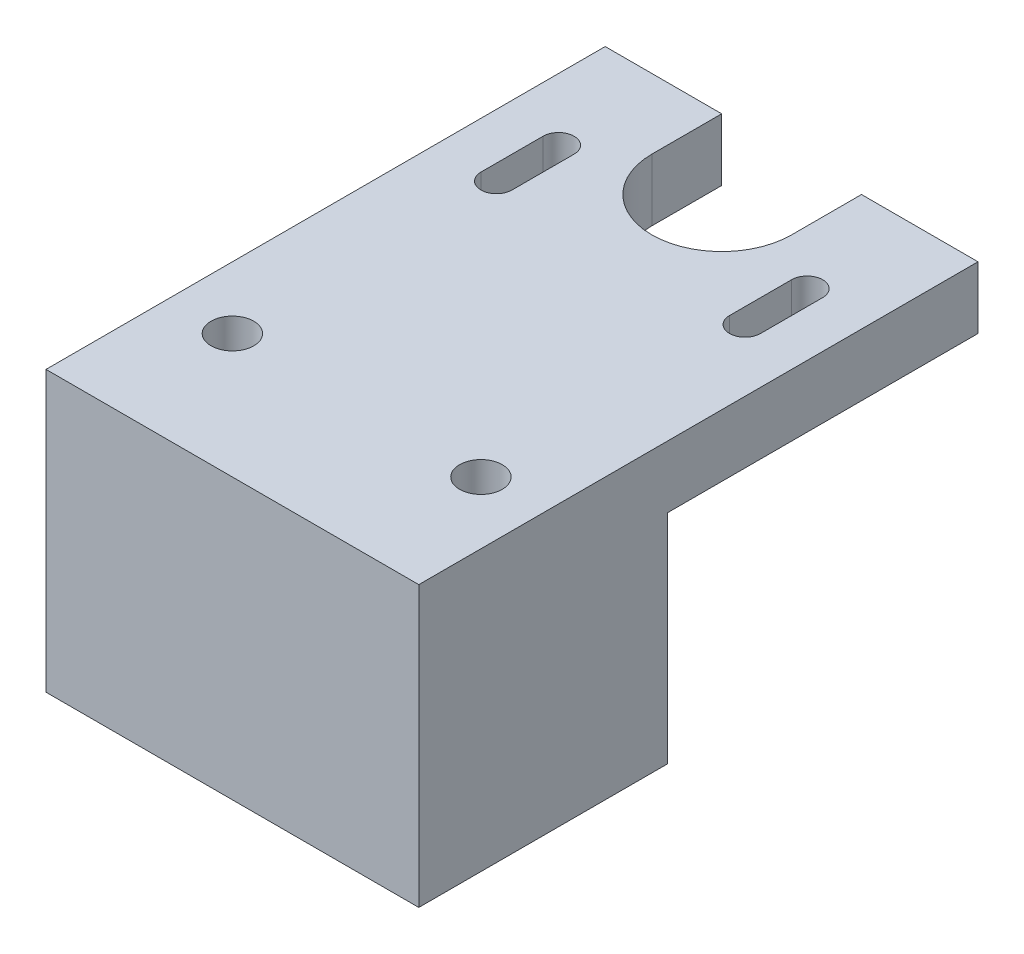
ISO-10303-21;
HEADER;
FILE_DESCRIPTION(('STEP AP214'),'2;1');
FILE_NAME('part.step','',(''),(''),'','','');
FILE_SCHEMA(('AUTOMOTIVE_DESIGN { 1 0 10303 214 1 1 1 1 }'));
ENDSEC;
DATA;
#1=APPLICATION_CONTEXT('core data for automotive mechanical design processes');
#2=APPLICATION_PROTOCOL_DEFINITION('international standard','automotive_design',2000,#1);
#3=PRODUCT_CONTEXT('',#1,'mechanical');
#4=PRODUCT('Part','Part','',(#3));
#5=PRODUCT_RELATED_PRODUCT_CATEGORY('part','',(#4));
#6=PRODUCT_DEFINITION_FORMATION('','',#4);
#7=PRODUCT_DEFINITION_CONTEXT('part definition',#1,'design');
#8=PRODUCT_DEFINITION('design','',#6,#7);
#9=PRODUCT_DEFINITION_SHAPE('','',#8);
#10=(LENGTH_UNIT() NAMED_UNIT(*) SI_UNIT(.MILLI.,.METRE.));
#11=(NAMED_UNIT(*) PLANE_ANGLE_UNIT() SI_UNIT($,.RADIAN.));
#12=(NAMED_UNIT(*) SI_UNIT($,.STERADIAN.) SOLID_ANGLE_UNIT());
#13=UNCERTAINTY_MEASURE_WITH_UNIT(LENGTH_MEASURE(1.E-05),#10,'distance_accuracy_value','');
#14=(GEOMETRIC_REPRESENTATION_CONTEXT(3) GLOBAL_UNCERTAINTY_ASSIGNED_CONTEXT((#13)) GLOBAL_UNIT_ASSIGNED_CONTEXT((#10,
#11,#12)) REPRESENTATION_CONTEXT('',''));
#15=CARTESIAN_POINT('',(0.,0.,0.));
#16=DIRECTION('',(0.,0.,1.));
#17=DIRECTION('',(1.,0.,0.));
#18=AXIS2_PLACEMENT_3D('',#15,#16,#17);
#19=CARTESIAN_POINT('',(38.1,57.15,-114.3));
#20=DIRECTION('',(0.,0.,1.));
#21=DIRECTION('',(0.,-1.,0.));
#22=AXIS2_PLACEMENT_3D('',#19,#20,#21);
#23=PLANE('',#22);
#24=DIRECTION('',(-1.,0.,0.));
#25=VECTOR('',#24,1.);
#26=CARTESIAN_POINT('',(38.1,44.4500000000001,-114.3));
#27=LINE('',#26,#25);
#28=CARTESIAN_POINT('',(38.1,44.4500000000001,-114.3));
#29=VERTEX_POINT('',#28);
#30=CARTESIAN_POINT('',(14.2875,44.4500000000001,-114.3));
#31=VERTEX_POINT('',#30);
#32=EDGE_CURVE('E316',#29,#31,#27,.T.);
#33=ORIENTED_EDGE('',*,*,#32,.T.);
#34=DIRECTION('',(0.,1.,0.));
#35=VECTOR('',#34,1.);
#36=CARTESIAN_POINT('',(14.2875,0.,-114.3));
#37=LINE('',#36,#35);
#38=CARTESIAN_POINT('',(14.2874999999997,57.15,-114.3));
#39=VERTEX_POINT('',#38);
#40=EDGE_CURVE('E226',#31,#39,#37,.T.);
#41=ORIENTED_EDGE('',*,*,#40,.T.);
#42=DIRECTION('',(-1.,0.,0.));
#43=VECTOR('',#42,1.);
#44=CARTESIAN_POINT('',(38.1,57.15,-114.3));
#45=LINE('',#44,#43);
#46=CARTESIAN_POINT('',(38.1,57.15,-114.3));
#47=VERTEX_POINT('',#46);
#48=EDGE_CURVE('E312',#47,#39,#45,.T.);
#49=ORIENTED_EDGE('',*,*,#48,.F.);
#50=DIRECTION('',(0.,1.,0.));
#51=VECTOR('',#50,1.);
#52=CARTESIAN_POINT('',(38.1,57.15,-114.3));
#53=LINE('',#52,#51);
#54=EDGE_CURVE('E286',#29,#47,#53,.T.);
#55=ORIENTED_EDGE('',*,*,#54,.F.);
#56=EDGE_LOOP('',(#33,#41,#49,#55));
#57=FACE_BOUND('',#56,.T.);
#58=ADVANCED_FACE('F44',(#57),#23,.F.);
#59=CARTESIAN_POINT('',(38.1,0.,-50.8));
#60=DIRECTION('',(0.,1.,0.));
#61=DIRECTION('',(0.,0.,1.));
#62=AXIS2_PLACEMENT_3D('',#59,#60,#61);
#63=PLANE('',#62);
#64=CARTESIAN_POINT('',(25.4,0.,-25.4));
#65=DIRECTION('',(0.,1.,0.));
#66=DIRECTION('',(0.,0.,-1.));
#67=AXIS2_PLACEMENT_3D('',#64,#65,#66);
#68=CIRCLE('',#67,4.3688);
#69=CARTESIAN_POINT('',(25.4,0.,-29.7688));
#70=VERTEX_POINT('',#69);
#71=EDGE_CURVE('E219',#70,#70,#68,.T.);
#72=ORIENTED_EDGE('',*,*,#71,.T.);
#73=EDGE_LOOP('',(#72));
#74=FACE_BOUND('',#73,.T.);
#75=CARTESIAN_POINT('',(-25.4000000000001,0.,-25.4));
#76=DIRECTION('',(0.,1.,0.));
#77=DIRECTION('',(0.,0.,1.));
#78=AXIS2_PLACEMENT_3D('',#75,#76,#77);
#79=CIRCLE('',#78,4.3688);
#80=CARTESIAN_POINT('',(-25.4000000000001,0.,-21.0312));
#81=VERTEX_POINT('',#80);
#82=EDGE_CURVE('E272',#81,#81,#79,.T.);
#83=ORIENTED_EDGE('',*,*,#82,.T.);
#84=EDGE_LOOP('',(#83));
#85=FACE_BOUND('',#84,.T.);
#86=DIRECTION('',(0.,0.,-1.));
#87=VECTOR('',#86,1.);
#88=CARTESIAN_POINT('',(-38.1000000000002,0.,-50.8));
#89=LINE('',#88,#87);
#90=CARTESIAN_POINT('',(-38.1000000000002,0.,0.));
#91=VERTEX_POINT('',#90);
#92=CARTESIAN_POINT('',(-38.1000000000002,0.,-50.8));
#93=VERTEX_POINT('',#92);
#94=EDGE_CURVE('E275',#91,#93,#89,.T.);
#95=ORIENTED_EDGE('',*,*,#94,.T.);
#96=DIRECTION('',(-1.,0.,0.));
#97=VECTOR('',#96,1.);
#98=CARTESIAN_POINT('',(38.1,0.,-50.8));
#99=LINE('',#98,#97);
#100=CARTESIAN_POINT('',(38.1,0.,-50.8));
#101=VERTEX_POINT('',#100);
#102=EDGE_CURVE('E13',#101,#93,#99,.T.);
#103=ORIENTED_EDGE('',*,*,#102,.F.);
#104=DIRECTION('',(0.,0.,-1.));
#105=VECTOR('',#104,1.);
#106=CARTESIAN_POINT('',(38.1,0.,-50.8));
#107=LINE('',#106,#105);
#108=CARTESIAN_POINT('',(38.1,0.,0.));
#109=VERTEX_POINT('',#108);
#110=EDGE_CURVE('E278',#109,#101,#107,.T.);
#111=ORIENTED_EDGE('',*,*,#110,.F.);
#112=DIRECTION('',(-1.,0.,0.));
#113=VECTOR('',#112,1.);
#114=CARTESIAN_POINT('',(38.1,0.,0.));
#115=LINE('',#114,#113);
#116=EDGE_CURVE('E292',#109,#91,#115,.T.);
#117=ORIENTED_EDGE('',*,*,#116,.T.);
#118=EDGE_LOOP('',(#95,#103,#111,#117));
#119=FACE_BOUND('',#118,.T.);
#120=ADVANCED_FACE('F46',(#74,#85,#119),#63,.F.);
#121=CARTESIAN_POINT('',(38.1,44.4500000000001,-50.8));
#122=DIRECTION('',(0.,0.,1.));
#123=DIRECTION('',(0.,-1.,0.));
#124=AXIS2_PLACEMENT_3D('',#121,#122,#123);
#125=PLANE('',#124);
#126=DIRECTION('',(0.,1.,0.));
#127=VECTOR('',#126,1.);
#128=CARTESIAN_POINT('',(-38.1000000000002,44.4500000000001,-50.8));
#129=LINE('',#128,#127);
#130=CARTESIAN_POINT('',(-38.1000000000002,44.4500000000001,-50.8));
#131=VERTEX_POINT('',#130);
#132=EDGE_CURVE('E295',#93,#131,#129,.T.);
#133=ORIENTED_EDGE('',*,*,#132,.T.);
#134=DIRECTION('',(-1.,0.,0.));
#135=VECTOR('',#134,1.);
#136=CARTESIAN_POINT('',(38.1,44.4500000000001,-50.8));
#137=LINE('',#136,#135);
#138=CARTESIAN_POINT('',(38.1,44.4500000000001,-50.8));
#139=VERTEX_POINT('',#138);
#140=EDGE_CURVE('E52',#139,#131,#137,.T.);
#141=ORIENTED_EDGE('',*,*,#140,.F.);
#142=DIRECTION('',(0.,1.,0.));
#143=VECTOR('',#142,1.);
#144=CARTESIAN_POINT('',(38.1,44.4500000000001,-50.8));
#145=LINE('',#144,#143);
#146=EDGE_CURVE('E281',#101,#139,#145,.T.);
#147=ORIENTED_EDGE('',*,*,#146,.F.);
#148=ORIENTED_EDGE('',*,*,#102,.T.);
#149=EDGE_LOOP('',(#133,#141,#147,#148));
#150=FACE_BOUND('',#149,.T.);
#151=ADVANCED_FACE('F357',(#150),#125,.F.);
#152=CARTESIAN_POINT('',(38.1,44.4500000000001,-114.3));
#153=DIRECTION('',(0.,1.,0.));
#154=DIRECTION('',(0.,0.,1.));
#155=AXIS2_PLACEMENT_3D('',#152,#153,#154);
#156=PLANE('',#155);
#157=DIRECTION('',(0.,0.,-1.));
#158=VECTOR('',#157,1.);
#159=CARTESIAN_POINT('',(-22.2250000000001,44.4500000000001,-114.3));
#160=LINE('',#159,#158);
#161=CARTESIAN_POINT('',(-22.2250000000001,44.4500000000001,-79.375));
#162=VERTEX_POINT('',#161);
#163=CARTESIAN_POINT('',(-22.2250000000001,44.4500000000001,-92.075));
#164=VERTEX_POINT('',#163);
#165=EDGE_CURVE('E265',#162,#164,#160,.T.);
#166=ORIENTED_EDGE('',*,*,#165,.T.);
#167=CARTESIAN_POINT('',(-25.4000000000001,44.4500000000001,-92.075));
#168=DIRECTION('',(0.,1.,0.));
#169=DIRECTION('',(0.,0.,1.));
#170=AXIS2_PLACEMENT_3D('',#167,#168,#169);
#171=CIRCLE('',#170,3.175);
#172=CARTESIAN_POINT('',(-28.5750000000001,44.4500000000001,-92.075));
#173=VERTEX_POINT('',#172);
#174=EDGE_CURVE('E268',#164,#173,#171,.T.);
#175=ORIENTED_EDGE('',*,*,#174,.T.);
#176=DIRECTION('',(0.,0.,1.));
#177=VECTOR('',#176,1.);
#178=CARTESIAN_POINT('',(-28.5750000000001,44.4500000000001,-114.3));
#179=LINE('',#178,#177);
#180=CARTESIAN_POINT('',(-28.5750000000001,44.4500000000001,-79.375));
#181=VERTEX_POINT('',#180);
#182=EDGE_CURVE('E259',#173,#181,#179,.T.);
#183=ORIENTED_EDGE('',*,*,#182,.T.);
#184=CARTESIAN_POINT('',(-25.4000000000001,44.4500000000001,-79.375));
#185=DIRECTION('',(0.,1.,0.));
#186=DIRECTION('',(0.,0.,1.));
#187=AXIS2_PLACEMENT_3D('',#184,#185,#186);
#188=CIRCLE('',#187,3.175);
#189=EDGE_CURVE('E262',#181,#162,#188,.T.);
#190=ORIENTED_EDGE('',*,*,#189,.T.);
#191=EDGE_LOOP('',(#166,#175,#183,#190));
#192=FACE_BOUND('',#191,.T.);
#193=DIRECTION('',(0.,0.,-1.));
#194=VECTOR('',#193,1.);
#195=CARTESIAN_POINT('',(28.575,44.4500000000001,-114.3));
#196=LINE('',#195,#194);
#197=CARTESIAN_POINT('',(28.575,44.4500000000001,-79.375));
#198=VERTEX_POINT('',#197);
#199=CARTESIAN_POINT('',(28.575,44.4500000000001,-92.075));
#200=VERTEX_POINT('',#199);
#201=EDGE_CURVE('E253',#198,#200,#196,.T.);
#202=ORIENTED_EDGE('',*,*,#201,.T.);
#203=CARTESIAN_POINT('',(25.3999999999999,44.4500000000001,-92.075));
#204=DIRECTION('',(0.,1.,0.));
#205=DIRECTION('',(0.,0.,1.));
#206=AXIS2_PLACEMENT_3D('',#203,#204,#205);
#207=CIRCLE('',#206,3.175);
#208=CARTESIAN_POINT('',(22.225,44.4500000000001,-92.075));
#209=VERTEX_POINT('',#208);
#210=EDGE_CURVE('E256',#200,#209,#207,.T.);
#211=ORIENTED_EDGE('',*,*,#210,.T.);
#212=DIRECTION('',(0.,0.,1.));
#213=VECTOR('',#212,1.);
#214=CARTESIAN_POINT('',(22.225,44.4500000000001,-114.3));
#215=LINE('',#214,#213);
#216=CARTESIAN_POINT('',(22.225,44.4500000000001,-79.375));
#217=VERTEX_POINT('',#216);
#218=EDGE_CURVE('E250',#209,#217,#215,.T.);
#219=ORIENTED_EDGE('',*,*,#218,.T.);
#220=CARTESIAN_POINT('',(25.3999999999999,44.4500000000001,-79.375));
#221=DIRECTION('',(0.,1.,0.));
#222=DIRECTION('',(0.,0.,1.));
#223=AXIS2_PLACEMENT_3D('',#220,#221,#222);
#224=CIRCLE('',#223,3.175);
#225=EDGE_CURVE('E174',#217,#198,#224,.T.);
#226=ORIENTED_EDGE('',*,*,#225,.T.);
#227=EDGE_LOOP('',(#202,#211,#219,#226));
#228=FACE_BOUND('',#227,.T.);
#229=CARTESIAN_POINT('',(0.,44.4500000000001,-100.0125));
#230=DIRECTION('',(0.,1.,0.));
#231=DIRECTION('',(0.,0.,1.));
#232=AXIS2_PLACEMENT_3D('',#229,#230,#231);
#233=CIRCLE('',#232,14.2875);
#234=CARTESIAN_POINT('',(-14.2875000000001,44.4500000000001,-100.0125));
#235=VERTEX_POINT('',#234);
#236=CARTESIAN_POINT('',(14.2875,44.4500000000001,-100.0125));
#237=VERTEX_POINT('',#236);
#238=EDGE_CURVE('E244',#235,#237,#233,.T.);
#239=ORIENTED_EDGE('',*,*,#238,.T.);
#240=DIRECTION('',(0.,0.,-1.));
#241=VECTOR('',#240,1.);
#242=CARTESIAN_POINT('',(14.2875,44.4500000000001,-114.3));
#243=LINE('',#242,#241);
#244=EDGE_CURVE('E247',#237,#31,#243,.T.);
#245=ORIENTED_EDGE('',*,*,#244,.T.);
#246=ORIENTED_EDGE('',*,*,#32,.F.);
#247=DIRECTION('',(0.,0.,-1.));
#248=VECTOR('',#247,1.);
#249=CARTESIAN_POINT('',(38.1,44.4500000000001,-114.3));
#250=LINE('',#249,#248);
#251=EDGE_CURVE('E284',#139,#29,#250,.T.);
#252=ORIENTED_EDGE('',*,*,#251,.F.);
#253=ORIENTED_EDGE('',*,*,#140,.T.);
#254=DIRECTION('',(0.,0.,-1.));
#255=VECTOR('',#254,1.);
#256=CARTESIAN_POINT('',(-38.1000000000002,44.4500000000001,-114.3));
#257=LINE('',#256,#255);
#258=CARTESIAN_POINT('',(-38.1000000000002,44.4500000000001,-114.3));
#259=VERTEX_POINT('',#258);
#260=EDGE_CURVE('E297',#131,#259,#257,.T.);
#261=ORIENTED_EDGE('',*,*,#260,.T.);
#262=CARTESIAN_POINT('',(-14.2875000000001,44.4500000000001,-114.3));
#263=VERTEX_POINT('',#262);
#264=EDGE_CURVE('E315',#263,#259,#27,.T.);
#265=ORIENTED_EDGE('',*,*,#264,.F.);
#266=DIRECTION('',(0.,0.,1.));
#267=VECTOR('',#266,1.);
#268=CARTESIAN_POINT('',(-14.2875000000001,44.4500000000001,-114.3));
#269=LINE('',#268,#267);
#270=EDGE_CURVE('E222',#263,#235,#269,.T.);
#271=ORIENTED_EDGE('',*,*,#270,.T.);
#272=EDGE_LOOP('',(#239,#245,#246,#252,#253,#261,#265,#271));
#273=FACE_BOUND('',#272,.T.);
#274=ADVANCED_FACE('F323',(#192,#228,#273),#156,.F.);
#275=CARTESIAN_POINT('',(-14.2875000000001,57.15,-114.3));
#276=VERTEX_POINT('',#275);
#277=CARTESIAN_POINT('',(-38.1000000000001,57.15,-114.3));
#278=VERTEX_POINT('',#277);
#279=EDGE_CURVE('E311',#276,#278,#45,.T.);
#280=ORIENTED_EDGE('',*,*,#279,.F.);
#281=DIRECTION('',(0.,1.,0.));
#282=VECTOR('',#281,1.);
#283=CARTESIAN_POINT('',(-14.2875000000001,0.,-114.3));
#284=LINE('',#283,#282);
#285=EDGE_CURVE('E234',#263,#276,#284,.T.);
#286=ORIENTED_EDGE('',*,*,#285,.F.);
#287=ORIENTED_EDGE('',*,*,#264,.T.);
#288=DIRECTION('',(0.,1.,0.));
#289=VECTOR('',#288,1.);
#290=CARTESIAN_POINT('',(-38.1000000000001,57.15,-114.3));
#291=LINE('',#290,#289);
#292=EDGE_CURVE('E300',#259,#278,#291,.T.);
#293=ORIENTED_EDGE('',*,*,#292,.T.);
#294=EDGE_LOOP('',(#280,#286,#287,#293));
#295=FACE_BOUND('',#294,.T.);
#296=ADVANCED_FACE('F335',(#295),#23,.F.);
#297=CARTESIAN_POINT('',(38.1,57.15,0.));
#298=DIRECTION('',(0.,-1.,0.));
#299=DIRECTION('',(0.,0.,-1.));
#300=AXIS2_PLACEMENT_3D('',#297,#298,#299);
#301=PLANE('',#300);
#302=DIRECTION('',(0.,0.,1.));
#303=VECTOR('',#302,1.);
#304=CARTESIAN_POINT('',(-28.5750000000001,57.15,-92.075));
#305=LINE('',#304,#303);
#306=CARTESIAN_POINT('',(-28.5750000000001,57.15,-92.075));
#307=VERTEX_POINT('',#306);
#308=CARTESIAN_POINT('',(-28.5750000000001,57.15,-79.375));
#309=VERTEX_POINT('',#308);
#310=EDGE_CURVE('E203',#307,#309,#305,.T.);
#311=ORIENTED_EDGE('',*,*,#310,.F.);
#312=CARTESIAN_POINT('',(-25.4000000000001,57.15,-92.075));
#313=DIRECTION('',(0.,1.,0.));
#314=DIRECTION('',(0.,0.,-1.));
#315=AXIS2_PLACEMENT_3D('',#312,#313,#314);
#316=CIRCLE('',#315,3.175);
#317=CARTESIAN_POINT('',(-22.2250000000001,57.15,-92.075));
#318=VERTEX_POINT('',#317);
#319=EDGE_CURVE('E201',#318,#307,#316,.T.);
#320=ORIENTED_EDGE('',*,*,#319,.F.);
#321=DIRECTION('',(0.,0.,-1.));
#322=VECTOR('',#321,1.);
#323=CARTESIAN_POINT('',(-22.2250000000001,57.15,-92.075));
#324=LINE('',#323,#322);
#325=CARTESIAN_POINT('',(-22.2250000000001,57.15,-79.375));
#326=VERTEX_POINT('',#325);
#327=EDGE_CURVE('E208',#326,#318,#324,.T.);
#328=ORIENTED_EDGE('',*,*,#327,.F.);
#329=CARTESIAN_POINT('',(-25.4000000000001,57.15,-79.375));
#330=DIRECTION('',(0.,1.,0.));
#331=DIRECTION('',(0.,0.,-1.));
#332=AXIS2_PLACEMENT_3D('',#329,#330,#331);
#333=CIRCLE('',#332,3.175);
#334=EDGE_CURVE('E205',#309,#326,#333,.T.);
#335=ORIENTED_EDGE('',*,*,#334,.F.);
#336=EDGE_LOOP('',(#311,#320,#328,#335));
#337=FACE_BOUND('',#336,.T.);
#338=DIRECTION('',(0.,0.,1.));
#339=VECTOR('',#338,1.);
#340=CARTESIAN_POINT('',(22.225,57.15,-92.075));
#341=LINE('',#340,#339);
#342=CARTESIAN_POINT('',(22.225,57.15,-92.075));
#343=VERTEX_POINT('',#342);
#344=CARTESIAN_POINT('',(22.225,57.15,-79.375));
#345=VERTEX_POINT('',#344);
#346=EDGE_CURVE('E181',#343,#345,#341,.T.);
#347=ORIENTED_EDGE('',*,*,#346,.F.);
#348=CARTESIAN_POINT('',(25.3999999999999,57.15,-92.075));
#349=DIRECTION('',(0.,1.,0.));
#350=DIRECTION('',(0.,0.,1.));
#351=AXIS2_PLACEMENT_3D('',#348,#349,#350);
#352=CIRCLE('',#351,3.175);
#353=CARTESIAN_POINT('',(28.575,57.15,-92.075));
#354=VERTEX_POINT('',#353);
#355=EDGE_CURVE('E186',#354,#343,#352,.T.);
#356=ORIENTED_EDGE('',*,*,#355,.F.);
#357=DIRECTION('',(0.,0.,-1.));
#358=VECTOR('',#357,1.);
#359=CARTESIAN_POINT('',(28.575,57.15,-92.075));
#360=LINE('',#359,#358);
#361=CARTESIAN_POINT('',(28.575,57.15,-79.375));
#362=VERTEX_POINT('',#361);
#363=EDGE_CURVE('E191',#362,#354,#360,.T.);
#364=ORIENTED_EDGE('',*,*,#363,.F.);
#365=CARTESIAN_POINT('',(25.3999999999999,57.15,-79.375));
#366=DIRECTION('',(0.,1.,0.));
#367=DIRECTION('',(0.,0.,1.));
#368=AXIS2_PLACEMENT_3D('',#365,#366,#367);
#369=CIRCLE('',#368,3.175);
#370=EDGE_CURVE('E171',#345,#362,#369,.T.);
#371=ORIENTED_EDGE('',*,*,#370,.F.);
#372=EDGE_LOOP('',(#347,#356,#364,#371));
#373=FACE_BOUND('',#372,.T.);
#374=CARTESIAN_POINT('',(25.3999999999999,57.15,-25.4));
#375=DIRECTION('',(0.,1.,0.));
#376=DIRECTION('',(0.,0.,-1.));
#377=AXIS2_PLACEMENT_3D('',#374,#375,#376);
#378=CIRCLE('',#377,4.3688);
#379=CARTESIAN_POINT('',(25.3999999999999,57.15,-29.7688));
#380=VERTEX_POINT('',#379);
#381=EDGE_CURVE('E223',#380,#380,#378,.T.);
#382=ORIENTED_EDGE('',*,*,#381,.F.);
#383=EDGE_LOOP('',(#382));
#384=FACE_BOUND('',#383,.T.);
#385=CARTESIAN_POINT('',(-25.4000000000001,57.15,-25.4));
#386=DIRECTION('',(0.,1.,0.));
#387=DIRECTION('',(0.,0.,1.));
#388=AXIS2_PLACEMENT_3D('',#385,#386,#387);
#389=CIRCLE('',#388,4.3688);
#390=CARTESIAN_POINT('',(-25.4000000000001,57.15,-21.0312));
#391=VERTEX_POINT('',#390);
#392=EDGE_CURVE('E271',#391,#391,#389,.T.);
#393=ORIENTED_EDGE('',*,*,#392,.F.);
#394=EDGE_LOOP('',(#393));
#395=FACE_BOUND('',#394,.T.);
#396=ORIENTED_EDGE('',*,*,#48,.T.);
#397=DIRECTION('',(0.,0.,-1.));
#398=VECTOR('',#397,1.);
#399=CARTESIAN_POINT('',(14.2874999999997,57.15,-114.3));
#400=LINE('',#399,#398);
#401=CARTESIAN_POINT('',(14.2874999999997,57.15,-100.0125));
#402=VERTEX_POINT('',#401);
#403=EDGE_CURVE('E232',#402,#39,#400,.T.);
#404=ORIENTED_EDGE('',*,*,#403,.F.);
#405=CARTESIAN_POINT('',(-2.35922392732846E-13,57.15,-100.0125));
#406=DIRECTION('',(0.,1.,0.));
#407=DIRECTION('',(0.,0.,1.));
#408=AXIS2_PLACEMENT_3D('',#405,#406,#407);
#409=CIRCLE('',#408,14.2875);
#410=CARTESIAN_POINT('',(-14.2875000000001,57.15,-100.0125));
#411=VERTEX_POINT('',#410);
#412=EDGE_CURVE('E229',#411,#402,#409,.T.);
#413=ORIENTED_EDGE('',*,*,#412,.F.);
#414=DIRECTION('',(0.,0.,1.));
#415=VECTOR('',#414,1.);
#416=CARTESIAN_POINT('',(-14.2875000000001,57.15,-114.3));
#417=LINE('',#416,#415);
#418=EDGE_CURVE('E198',#276,#411,#417,.T.);
#419=ORIENTED_EDGE('',*,*,#418,.F.);
#420=ORIENTED_EDGE('',*,*,#279,.T.);
#421=DIRECTION('',(0.,0.,1.));
#422=VECTOR('',#421,1.);
#423=CARTESIAN_POINT('',(-38.1000000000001,57.15,0.));
#424=LINE('',#423,#422);
#425=CARTESIAN_POINT('',(-38.1000000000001,57.15,0.));
#426=VERTEX_POINT('',#425);
#427=EDGE_CURVE('E303',#278,#426,#424,.T.);
#428=ORIENTED_EDGE('',*,*,#427,.T.);
#429=DIRECTION('',(-1.,0.,0.));
#430=VECTOR('',#429,1.);
#431=CARTESIAN_POINT('',(38.1,57.15,0.));
#432=LINE('',#431,#430);
#433=CARTESIAN_POINT('',(38.1,57.15,0.));
#434=VERTEX_POINT('',#433);
#435=EDGE_CURVE('E308',#434,#426,#432,.T.);
#436=ORIENTED_EDGE('',*,*,#435,.F.);
#437=DIRECTION('',(0.,0.,1.));
#438=VECTOR('',#437,1.);
#439=CARTESIAN_POINT('',(38.1,57.15,0.));
#440=LINE('',#439,#438);
#441=EDGE_CURVE('E288',#47,#434,#440,.T.);
#442=ORIENTED_EDGE('',*,*,#441,.F.);
#443=EDGE_LOOP('',(#396,#404,#413,#419,#420,#428,#436,#442));
#444=FACE_BOUND('',#443,.T.);
#445=ADVANCED_FACE('F188',(#337,#373,#384,#395,#444),#301,.F.);
#446=CARTESIAN_POINT('',(38.1,0.,0.));
#447=DIRECTION('',(0.,0.,-1.));
#448=DIRECTION('',(-1.,0.,0.));
#449=AXIS2_PLACEMENT_3D('',#446,#447,#448);
#450=PLANE('',#449);
#451=DIRECTION('',(0.,-1.,0.));
#452=VECTOR('',#451,1.);
#453=CARTESIAN_POINT('',(-38.1000000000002,0.,0.));
#454=LINE('',#453,#452);
#455=EDGE_CURVE('E282',#426,#91,#454,.T.);
#456=ORIENTED_EDGE('',*,*,#455,.T.);
#457=ORIENTED_EDGE('',*,*,#116,.F.);
#458=DIRECTION('',(0.,-1.,0.));
#459=VECTOR('',#458,1.);
#460=CARTESIAN_POINT('',(38.1,0.,0.));
#461=LINE('',#460,#459);
#462=EDGE_CURVE('E290',#434,#109,#461,.T.);
#463=ORIENTED_EDGE('',*,*,#462,.F.);
#464=ORIENTED_EDGE('',*,*,#435,.T.);
#465=EDGE_LOOP('',(#456,#457,#463,#464));
#466=FACE_BOUND('',#465,.T.);
#467=ADVANCED_FACE('F361',(#466),#450,.F.);
#468=CARTESIAN_POINT('',(38.1,0.,0.));
#469=DIRECTION('',(-1.,0.,0.));
#470=DIRECTION('',(0.,0.,1.));
#471=AXIS2_PLACEMENT_3D('',#468,#469,#470);
#472=PLANE('',#471);
#473=ORIENTED_EDGE('',*,*,#110,.T.);
#474=ORIENTED_EDGE('',*,*,#146,.T.);
#475=ORIENTED_EDGE('',*,*,#251,.T.);
#476=ORIENTED_EDGE('',*,*,#54,.T.);
#477=ORIENTED_EDGE('',*,*,#441,.T.);
#478=ORIENTED_EDGE('',*,*,#462,.T.);
#479=EDGE_LOOP('',(#473,#474,#475,#476,#477,#478));
#480=FACE_BOUND('',#479,.T.);
#481=ADVANCED_FACE('F353',(#480),#472,.F.);
#482=CARTESIAN_POINT('',(-38.1000000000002,0.,0.));
#483=DIRECTION('',(-1.,0.,0.));
#484=DIRECTION('',(0.,0.,1.));
#485=AXIS2_PLACEMENT_3D('',#482,#483,#484);
#486=PLANE('',#485);
#487=ORIENTED_EDGE('',*,*,#94,.F.);
#488=ORIENTED_EDGE('',*,*,#455,.F.);
#489=ORIENTED_EDGE('',*,*,#427,.F.);
#490=ORIENTED_EDGE('',*,*,#292,.F.);
#491=ORIENTED_EDGE('',*,*,#260,.F.);
#492=ORIENTED_EDGE('',*,*,#132,.F.);
#493=EDGE_LOOP('',(#487,#488,#489,#490,#491,#492));
#494=FACE_BOUND('',#493,.T.);
#495=ADVANCED_FACE('F330',(#494),#486,.T.);
#496=CARTESIAN_POINT('',(-25.4000000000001,0.,-25.4));
#497=DIRECTION('',(0.,1.,0.));
#498=DIRECTION('',(0.,0.,1.));
#499=AXIS2_PLACEMENT_3D('',#496,#497,#498);
#500=CYLINDRICAL_SURFACE('',#499,4.3688);
#501=ORIENTED_EDGE('',*,*,#82,.F.);
#502=EDGE_LOOP('',(#501));
#503=FACE_BOUND('',#502,.T.);
#504=ORIENTED_EDGE('',*,*,#392,.T.);
#505=EDGE_LOOP('',(#504));
#506=FACE_BOUND('',#505,.T.);
#507=ADVANCED_FACE('F422',(#503,#506),#500,.F.);
#508=CARTESIAN_POINT('',(25.4,0.,-25.4));
#509=DIRECTION('',(0.,1.,0.));
#510=DIRECTION('',(0.,0.,1.));
#511=AXIS2_PLACEMENT_3D('',#508,#509,#510);
#512=CYLINDRICAL_SURFACE('',#511,4.3688);
#513=ORIENTED_EDGE('',*,*,#71,.F.);
#514=EDGE_LOOP('',(#513));
#515=FACE_BOUND('',#514,.T.);
#516=ORIENTED_EDGE('',*,*,#381,.T.);
#517=EDGE_LOOP('',(#516));
#518=FACE_BOUND('',#517,.T.);
#519=ADVANCED_FACE('F432',(#515,#518),#512,.F.);
#520=CARTESIAN_POINT('',(14.2875,0.,-114.3));
#521=DIRECTION('',(1.,0.,0.));
#522=DIRECTION('',(0.,0.,-1.));
#523=AXIS2_PLACEMENT_3D('',#520,#521,#522);
#524=PLANE('',#523);
#525=DIRECTION('',(0.,1.,0.));
#526=VECTOR('',#525,1.);
#527=CARTESIAN_POINT('',(14.2875,0.,-100.0125));
#528=LINE('',#527,#526);
#529=EDGE_CURVE('E237',#237,#402,#528,.T.);
#530=ORIENTED_EDGE('',*,*,#529,.T.);
#531=ORIENTED_EDGE('',*,*,#403,.T.);
#532=ORIENTED_EDGE('',*,*,#40,.F.);
#533=ORIENTED_EDGE('',*,*,#244,.F.);
#534=EDGE_LOOP('',(#530,#531,#532,#533));
#535=FACE_BOUND('',#534,.T.);
#536=ADVANCED_FACE('F347',(#535),#524,.F.);
#537=CARTESIAN_POINT('',(0.,0.,-100.0125));
#538=DIRECTION('',(0.,1.,0.));
#539=DIRECTION('',(0.,0.,1.));
#540=AXIS2_PLACEMENT_3D('',#537,#538,#539);
#541=CYLINDRICAL_SURFACE('',#540,14.2875);
#542=DIRECTION('',(0.,1.,0.));
#543=VECTOR('',#542,1.);
#544=CARTESIAN_POINT('',(-14.2875000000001,0.,-100.0125));
#545=LINE('',#544,#543);
#546=EDGE_CURVE('E239',#235,#411,#545,.T.);
#547=ORIENTED_EDGE('',*,*,#546,.T.);
#548=ORIENTED_EDGE('',*,*,#412,.T.);
#549=ORIENTED_EDGE('',*,*,#529,.F.);
#550=ORIENTED_EDGE('',*,*,#238,.F.);
#551=EDGE_LOOP('',(#547,#548,#549,#550));
#552=FACE_BOUND('',#551,.T.);
#553=ADVANCED_FACE('F343',(#552),#541,.F.);
#554=CARTESIAN_POINT('',(-14.2875000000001,0.,-114.3));
#555=DIRECTION('',(-1.,0.,0.));
#556=DIRECTION('',(0.,0.,1.));
#557=AXIS2_PLACEMENT_3D('',#554,#555,#556);
#558=PLANE('',#557);
#559=ORIENTED_EDGE('',*,*,#285,.T.);
#560=ORIENTED_EDGE('',*,*,#418,.T.);
#561=ORIENTED_EDGE('',*,*,#546,.F.);
#562=ORIENTED_EDGE('',*,*,#270,.F.);
#563=EDGE_LOOP('',(#559,#560,#561,#562));
#564=FACE_BOUND('',#563,.T.);
#565=ADVANCED_FACE('F339',(#564),#558,.F.);
#566=CARTESIAN_POINT('',(25.4,0.,-92.075));
#567=DIRECTION('',(0.,1.,0.));
#568=DIRECTION('',(0.,0.,1.));
#569=AXIS2_PLACEMENT_3D('',#566,#567,#568);
#570=CYLINDRICAL_SURFACE('',#569,3.175);
#571=DIRECTION('',(0.,1.,0.));
#572=VECTOR('',#571,1.);
#573=CARTESIAN_POINT('',(28.575,0.,-92.075));
#574=LINE('',#573,#572);
#575=EDGE_CURVE('E196',#200,#354,#574,.T.);
#576=ORIENTED_EDGE('',*,*,#575,.T.);
#577=ORIENTED_EDGE('',*,*,#355,.T.);
#578=DIRECTION('',(0.,1.,0.));
#579=VECTOR('',#578,1.);
#580=CARTESIAN_POINT('',(22.225,0.,-92.075));
#581=LINE('',#580,#579);
#582=EDGE_CURVE('E177',#209,#343,#581,.T.);
#583=ORIENTED_EDGE('',*,*,#582,.F.);
#584=ORIENTED_EDGE('',*,*,#210,.F.);
#585=EDGE_LOOP('',(#576,#577,#583,#584));
#586=FACE_BOUND('',#585,.T.);
#587=ADVANCED_FACE('F467',(#586),#570,.F.);
#588=CARTESIAN_POINT('',(28.575,0.,-92.075));
#589=DIRECTION('',(1.,0.,0.));
#590=DIRECTION('',(0.,0.,-1.));
#591=AXIS2_PLACEMENT_3D('',#588,#589,#590);
#592=PLANE('',#591);
#593=DIRECTION('',(0.,1.,0.));
#594=VECTOR('',#593,1.);
#595=CARTESIAN_POINT('',(28.575,0.,-79.375));
#596=LINE('',#595,#594);
#597=EDGE_CURVE('E176',#198,#362,#596,.T.);
#598=ORIENTED_EDGE('',*,*,#597,.T.);
#599=ORIENTED_EDGE('',*,*,#363,.T.);
#600=ORIENTED_EDGE('',*,*,#575,.F.);
#601=ORIENTED_EDGE('',*,*,#201,.F.);
#602=EDGE_LOOP('',(#598,#599,#600,#601));
#603=FACE_BOUND('',#602,.T.);
#604=ADVANCED_FACE('F476',(#603),#592,.F.);
#605=CARTESIAN_POINT('',(25.4,0.,-79.375));
#606=DIRECTION('',(0.,1.,0.));
#607=DIRECTION('',(0.,0.,1.));
#608=AXIS2_PLACEMENT_3D('',#605,#606,#607);
#609=CYLINDRICAL_SURFACE('',#608,3.175);
#610=DIRECTION('',(0.,1.,0.));
#611=VECTOR('',#610,1.);
#612=CARTESIAN_POINT('',(22.225,0.,-79.375));
#613=LINE('',#612,#611);
#614=EDGE_CURVE('E67',#217,#345,#613,.T.);
#615=ORIENTED_EDGE('',*,*,#614,.T.);
#616=ORIENTED_EDGE('',*,*,#370,.T.);
#617=ORIENTED_EDGE('',*,*,#597,.F.);
#618=ORIENTED_EDGE('',*,*,#225,.F.);
#619=EDGE_LOOP('',(#615,#616,#617,#618));
#620=FACE_BOUND('',#619,.T.);
#621=ADVANCED_FACE('F168',(#620),#609,.F.);
#622=CARTESIAN_POINT('',(22.225,0.,-92.075));
#623=DIRECTION('',(-1.,0.,0.));
#624=DIRECTION('',(0.,0.,1.));
#625=AXIS2_PLACEMENT_3D('',#622,#623,#624);
#626=PLANE('',#625);
#627=ORIENTED_EDGE('',*,*,#582,.T.);
#628=ORIENTED_EDGE('',*,*,#346,.T.);
#629=ORIENTED_EDGE('',*,*,#614,.F.);
#630=ORIENTED_EDGE('',*,*,#218,.F.);
#631=EDGE_LOOP('',(#627,#628,#629,#630));
#632=FACE_BOUND('',#631,.T.);
#633=ADVANCED_FACE('F182',(#632),#626,.F.);
#634=CARTESIAN_POINT('',(-25.4000000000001,0.,-92.075));
#635=DIRECTION('',(0.,1.,0.));
#636=DIRECTION('',(0.,0.,1.));
#637=AXIS2_PLACEMENT_3D('',#634,#635,#636);
#638=CYLINDRICAL_SURFACE('',#637,3.175);
#639=DIRECTION('',(0.,1.,0.));
#640=VECTOR('',#639,1.);
#641=CARTESIAN_POINT('',(-22.2250000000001,0.,-92.075));
#642=LINE('',#641,#640);
#643=EDGE_CURVE('E212',#164,#318,#642,.T.);
#644=ORIENTED_EDGE('',*,*,#643,.T.);
#645=ORIENTED_EDGE('',*,*,#319,.T.);
#646=DIRECTION('',(0.,1.,0.));
#647=VECTOR('',#646,1.);
#648=CARTESIAN_POINT('',(-28.5750000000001,0.,-92.075));
#649=LINE('',#648,#647);
#650=EDGE_CURVE('E211',#173,#307,#649,.T.);
#651=ORIENTED_EDGE('',*,*,#650,.F.);
#652=ORIENTED_EDGE('',*,*,#174,.F.);
#653=EDGE_LOOP('',(#644,#645,#651,#652));
#654=FACE_BOUND('',#653,.T.);
#655=ADVANCED_FACE('F503',(#654),#638,.F.);
#656=CARTESIAN_POINT('',(-22.2250000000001,0.,-92.075));
#657=DIRECTION('',(1.,0.,0.));
#658=DIRECTION('',(0.,0.,-1.));
#659=AXIS2_PLACEMENT_3D('',#656,#657,#658);
#660=PLANE('',#659);
#661=DIRECTION('',(0.,1.,0.));
#662=VECTOR('',#661,1.);
#663=CARTESIAN_POINT('',(-22.2250000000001,0.,-79.375));
#664=LINE('',#663,#662);
#665=EDGE_CURVE('E214',#162,#326,#664,.T.);
#666=ORIENTED_EDGE('',*,*,#665,.T.);
#667=ORIENTED_EDGE('',*,*,#327,.T.);
#668=ORIENTED_EDGE('',*,*,#643,.F.);
#669=ORIENTED_EDGE('',*,*,#165,.F.);
#670=EDGE_LOOP('',(#666,#667,#668,#669));
#671=FACE_BOUND('',#670,.T.);
#672=ADVANCED_FACE('F512',(#671),#660,.F.);
#673=CARTESIAN_POINT('',(-25.4000000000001,0.,-79.375));
#674=DIRECTION('',(0.,1.,0.));
#675=DIRECTION('',(0.,0.,1.));
#676=AXIS2_PLACEMENT_3D('',#673,#674,#675);
#677=CYLINDRICAL_SURFACE('',#676,3.175);
#678=DIRECTION('',(0.,1.,0.));
#679=VECTOR('',#678,1.);
#680=CARTESIAN_POINT('',(-28.5750000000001,0.,-79.375));
#681=LINE('',#680,#679);
#682=EDGE_CURVE('E59',#181,#309,#681,.T.);
#683=ORIENTED_EDGE('',*,*,#682,.T.);
#684=ORIENTED_EDGE('',*,*,#334,.T.);
#685=ORIENTED_EDGE('',*,*,#665,.F.);
#686=ORIENTED_EDGE('',*,*,#189,.F.);
#687=EDGE_LOOP('',(#683,#684,#685,#686));
#688=FACE_BOUND('',#687,.T.);
#689=ADVANCED_FACE('F522',(#688),#677,.F.);
#690=CARTESIAN_POINT('',(-28.5750000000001,0.,-92.075));
#691=DIRECTION('',(-1.,0.,0.));
#692=DIRECTION('',(0.,0.,1.));
#693=AXIS2_PLACEMENT_3D('',#690,#691,#692);
#694=PLANE('',#693);
#695=ORIENTED_EDGE('',*,*,#650,.T.);
#696=ORIENTED_EDGE('',*,*,#310,.T.);
#697=ORIENTED_EDGE('',*,*,#682,.F.);
#698=ORIENTED_EDGE('',*,*,#182,.F.);
#699=EDGE_LOOP('',(#695,#696,#697,#698));
#700=FACE_BOUND('',#699,.T.);
#701=ADVANCED_FACE('F532',(#700),#694,.F.);
#702=CLOSED_SHELL('',(#58,#120,#151,#274,#296,#445,#467,#481,#495,#507,#519,#536,#553,#565,#587,
#604,#621,#633,#655,#672,#689,#701));
#703=MANIFOLD_SOLID_BREP('B2',#702);
#704=ADVANCED_BREP_SHAPE_REPRESENTATION('',(#18,#703),#14);
#705=SHAPE_DEFINITION_REPRESENTATION(#9,#704);
ENDSEC;
END-ISO-10303-21;
